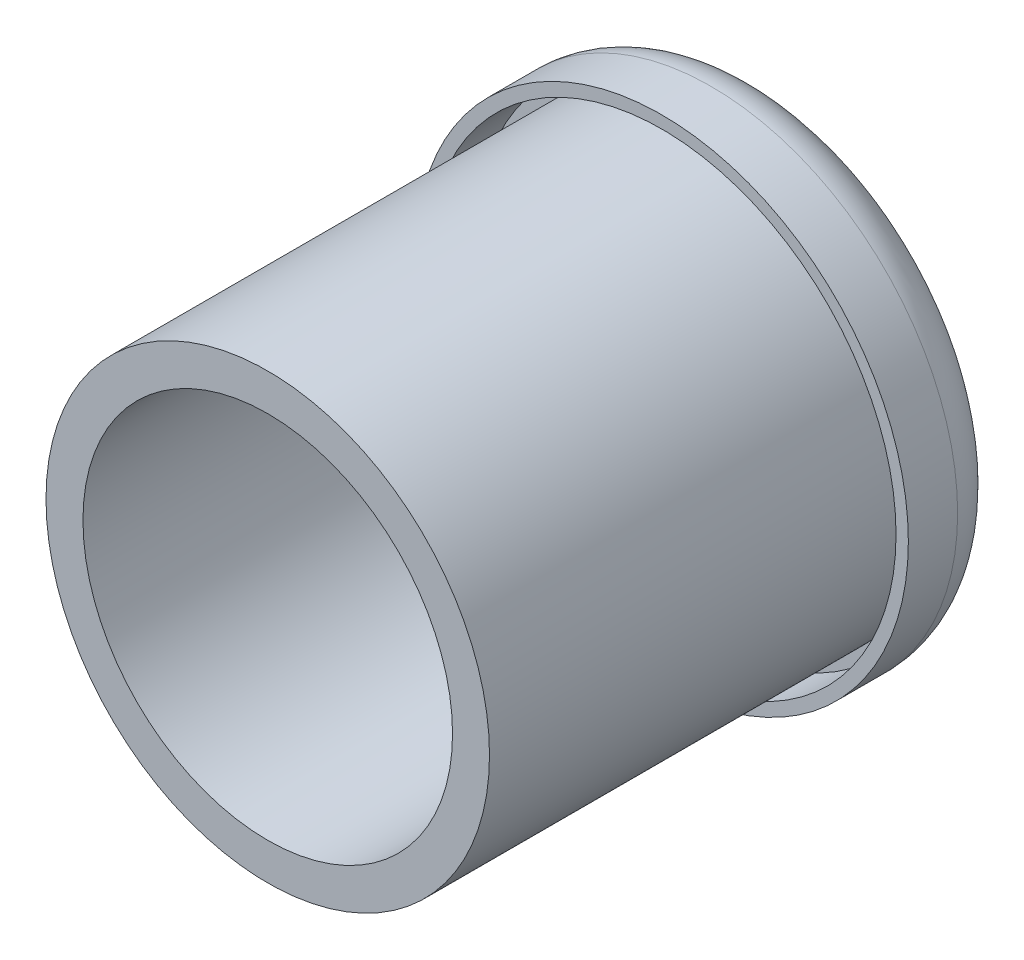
from build123d import *

# Parameters (mm, degrees)
ESQUISSE1_R             = 5
EXTRUSION1_DEPTH        = 10
ESQUISSE2_R             = 3.75
ENL_V_MAT_EXTRU_1_DEPTH = 13.247448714
ESQUISSE3_R             = 4.75
ESQUISSE3_R_2           = 4.5
ENL_V_MAT_EXTRU_2_DEPTH = 9
ESQUISSE4_R             = 5
ESQUISSE4_R_2           = 4.75
ENL_V_MAT_EXTRU_3_DEPTH = 8
CONG_1_R                = 1


with BuildPart() as part:
    # Esquisse1 → Extrusion1 (new body)
    with BuildSketch(Plane.XY):
        Circle(ESQUISSE1_R)
    extrude(amount=EXTRUSION1_DEPTH)

    # Esquisse2 → Enl_v. mat.-Extru.1 (cut, through all)
    with BuildSketch(Plane.XY.offset(10)):
        Circle(ESQUISSE2_R)
    extrude(amount=-ENL_V_MAT_EXTRU_1_DEPTH, mode=Mode.SUBTRACT)

    # Esquisse3 → Enl_v. mat.-Extru.2 (cut)
    with BuildSketch(Plane.XY.offset(10)):
        Circle(ESQUISSE3_R)
        Circle(ESQUISSE3_R_2, mode=Mode.SUBTRACT)
    extrude(amount=-ENL_V_MAT_EXTRU_2_DEPTH, mode=Mode.SUBTRACT)

    # Esquisse4 → Enl_v. mat.-Extru.3 (cut)
    with BuildSketch(Plane.XY.offset(10)):
        Circle(ESQUISSE4_R)
        Circle(ESQUISSE4_R_2, mode=Mode.SUBTRACT)
    extrude(amount=-ENL_V_MAT_EXTRU_3_DEPTH, mode=Mode.SUBTRACT)

    # Cong_1
    cong_1_edges = [part.edges().sort_by_distance(p)[0] for p in [
        (-5, 0, 0),
    ]]
    fillet(cong_1_edges, radius=CONG_1_R)


solid = part.part
